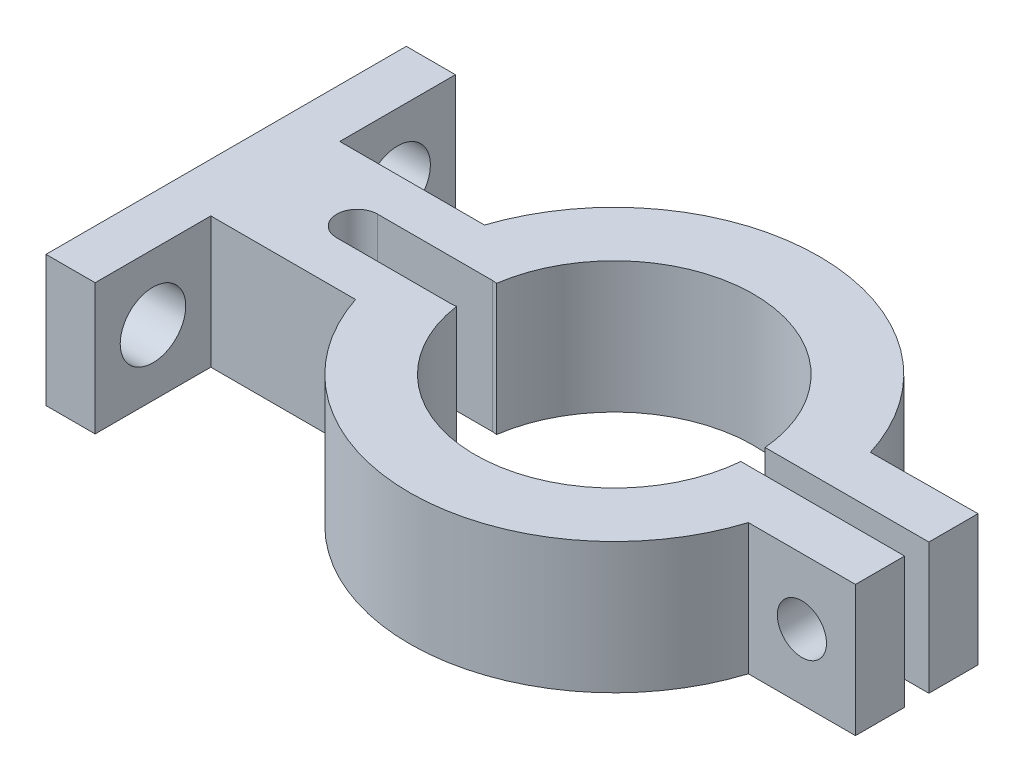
from build123d import *

# Parameters (mm, degrees)
BOSS_EXTRUDE1_DEPTH = 8
SKETCH2_R           = 2
CUT_EXTRUDE2_DEPTH  = 3
SKETCH4_R           = 1.5
CUT_EXTRUDE3_DEPTH  = 40.110237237
CUT_EXTRUDE4_DEPTH  = 38.710692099


with BuildPart() as part:
    # Sketch1 → Boss-Extrude1 (new body)
    with BuildSketch(Plane(origin=(0, 0, 0), x_dir=(1, 0, 0), z_dir=(0, 1, 0))):
        with BuildLine():
            Line((-4.5, -11), (-4.5, -3.937007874))
            Line((-4.5, -3.937007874), (4.336190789, -3.937007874))
            ThreePointArc((4.336190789, -3.937007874), (16.30307362, -12.499575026), (28.127121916, -3.740823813))
            Line((28.127121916, -3.740823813), (34.667654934, -3.740823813))
            Line((34.667654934, -3.740823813), (34.667654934, -0.740823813))
            Line((34.667654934, -0.740823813), (24.667654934, -0.740823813))
            ThreePointArc((24.667654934, -0.740823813), (7.7, 0), (24.667654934, 0.740823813))
            Line((24.667654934, 0.740823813), (34.667654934, 0.740823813))
            Line((34.667654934, 0.740823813), (34.667654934, 3.740823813))
            Line((34.667654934, 3.740823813), (28.140137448, 3.699069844))
            ThreePointArc((28.140137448, 3.699069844), (16.324940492, 12.499375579), (4.336190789, 3.937007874))
            Line((4.336190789, 3.937007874), (-4.5, 3.937007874))
            Line((-4.5, 3.937007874), (-4.5, 11))
            Line((-4.5, 11), (-7.5, 11))
            Line((-7.5, 11), (-7.5, 4))
            Line((-7.5, 4), (-7.5, 3.758254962))
            Line((-7.5, 3.758254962), (-7.5, -4))
            Line((-7.5, -4), (-7.5, -11))
            Line((-7.5, -11), (-4.5, -11))
        make_face()
    extrude(amount=BOSS_EXTRUDE1_DEPTH)

    # Sketch2 → Cut-Extrude2 (cut)
    with BuildSketch(Plane.ZY.offset(7.5)):
        with Locations((7.468503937, 4)):
            Circle(SKETCH2_R)
        with Locations((-7.468503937, 4)):
            Circle(SKETCH2_R)
    extrude(amount=-CUT_EXTRUDE2_DEPTH, mode=Mode.SUBTRACT)

    # Sketch4 → Cut-Extrude3 (cut, through all)
    with BuildSketch(Plane.XY.offset(3.740823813)):
        with Locations(Location((31.397388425, 4, 0), (0, 0, 180))):
            Circle(SKETCH4_R)
    extrude(amount=-CUT_EXTRUDE3_DEPTH, mode=Mode.SUBTRACT)

    # Sketch5 → Cut-Extrude4 (cut, through all)
    with BuildSketch(Plane(origin=(0, 8, 0), x_dir=(1, 0, 0), z_dir=(0, 1, 0))):
        with BuildLine():
            Line((0.5, 1.25), (7.5, 1.25))
            ThreePointArc((7.5, 1.25), (8.75, 0), (7.5, -1.25))
            Line((7.5, -1.25), (0.5, -1.25))
            ThreePointArc((0.5, -1.25), (-0.75, 0), (0.5, 1.25))
        make_face()
    extrude(amount=-CUT_EXTRUDE4_DEPTH, mode=Mode.SUBTRACT)


solid = part.part
